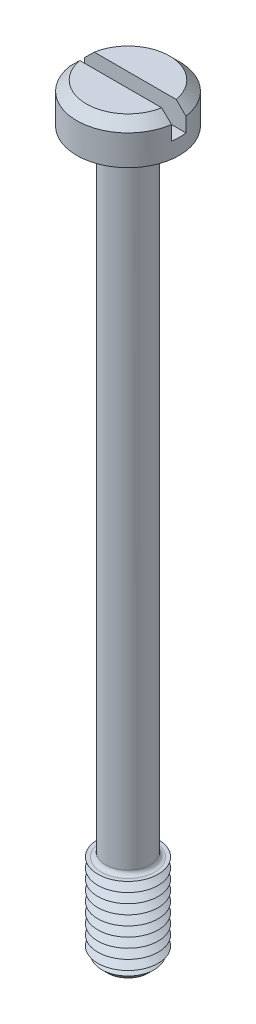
ISO-10303-21;
HEADER;
FILE_DESCRIPTION(('STEP AP214'),'2;1');
FILE_NAME('part.step','',(''),(''),'','','');
FILE_SCHEMA(('AUTOMOTIVE_DESIGN { 1 0 10303 214 1 1 1 1 }'));
ENDSEC;
DATA;
#1=APPLICATION_CONTEXT('core data for automotive mechanical design processes');
#2=APPLICATION_PROTOCOL_DEFINITION('international standard','automotive_design',2000,#1);
#3=PRODUCT_CONTEXT('',#1,'mechanical');
#4=PRODUCT('Part','Part','',(#3));
#5=PRODUCT_RELATED_PRODUCT_CATEGORY('part','',(#4));
#6=PRODUCT_DEFINITION_FORMATION('','',#4);
#7=PRODUCT_DEFINITION_CONTEXT('part definition',#1,'design');
#8=PRODUCT_DEFINITION('design','',#6,#7);
#9=PRODUCT_DEFINITION_SHAPE('','',#8);
#10=(LENGTH_UNIT() NAMED_UNIT(*) SI_UNIT(.MILLI.,.METRE.));
#11=(NAMED_UNIT(*) PLANE_ANGLE_UNIT() SI_UNIT($,.RADIAN.));
#12=(NAMED_UNIT(*) SI_UNIT($,.STERADIAN.) SOLID_ANGLE_UNIT());
#13=UNCERTAINTY_MEASURE_WITH_UNIT(LENGTH_MEASURE(1.E-05),#10,'distance_accuracy_value','');
#14=(GEOMETRIC_REPRESENTATION_CONTEXT(3) GLOBAL_UNCERTAINTY_ASSIGNED_CONTEXT((#13)) GLOBAL_UNIT_ASSIGNED_CONTEXT((#10,
#11,#12)) REPRESENTATION_CONTEXT('',''));
#15=CARTESIAN_POINT('',(0.,0.,0.));
#16=DIRECTION('',(0.,0.,1.));
#17=DIRECTION('',(1.,0.,0.));
#18=AXIS2_PLACEMENT_3D('',#15,#16,#17);
#19=CARTESIAN_POINT('',(0.,3.3,0.));
#20=DIRECTION('',(0.,1.,0.));
#21=DIRECTION('',(0.,0.,1.));
#22=AXIS2_PLACEMENT_3D('',#19,#20,#21);
#23=PLANE('',#22);
#24=DIRECTION('',(-1.,0.,0.));
#25=VECTOR('',#24,1.);
#26=CARTESIAN_POINT('',(4.25,3.3,-0.6));
#27=LINE('',#26,#25);
#28=CARTESIAN_POINT('',(3.39742549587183,3.3,-0.6));
#29=VERTEX_POINT('',#28);
#30=CARTESIAN_POINT('',(-3.39742549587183,3.3,-0.6));
#31=VERTEX_POINT('',#30);
#32=EDGE_CURVE('E110',#29,#31,#27,.T.);
#33=ORIENTED_EDGE('',*,*,#32,.F.);
#34=CARTESIAN_POINT('',(0.,3.3,0.));
#35=DIRECTION('',(0.,1.,0.));
#36=DIRECTION('',(0.,0.,1.));
#37=AXIS2_PLACEMENT_3D('',#34,#35,#36);
#38=CIRCLE('',#37,3.44999999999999);
#39=EDGE_CURVE('E113',#29,#31,#38,.T.);
#40=ORIENTED_EDGE('',*,*,#39,.T.);
#41=EDGE_LOOP('',(#33,#40));
#42=FACE_BOUND('',#41,.T.);
#43=ADVANCED_FACE('F39',(#42),#23,.T.);
#44=CARTESIAN_POINT('',(0.,3.3,0.));
#45=DIRECTION('',(0.,-1.,0.));
#46=DIRECTION('',(0.,0.,-1.));
#47=AXIS2_PLACEMENT_3D('',#44,#45,#46);
#48=CONICAL_SURFACE('',#47,3.44999999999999,0.785398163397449);
#49=CARTESIAN_POINT('',(9.35351408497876,-2.62273843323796,-0.6));
#50=CARTESIAN_POINT('',(9.03263557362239,-2.30252317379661,-0.6));
#51=CARTESIAN_POINT('',(8.7117281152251,-1.98233690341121,-0.6));
#52=CARTESIAN_POINT('',(8.069812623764,-1.34205341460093,-0.6));
#53=CARTESIAN_POINT('',(7.7488045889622,-1.02195619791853,-0.6));
#54=CARTESIAN_POINT('',(7.10652460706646,-0.381761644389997,-0.6));
#55=CARTESIAN_POINT('',(6.78525260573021,-0.0616643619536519,-0.6));
#56=CARTESIAN_POINT('',(6.14251393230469,0.578323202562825,-0.6));
#57=CARTESIAN_POINT('',(5.82104726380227,0.898213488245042,-0.6));
#58=CARTESIAN_POINT('',(5.1719620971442,1.54347500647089,-0.6));
#59=CARTESIAN_POINT('',(4.84433778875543,1.86884039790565,-0.6));
#60=CARTESIAN_POINT('',(4.35244442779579,2.35644593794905,-0.6));
#61=CARTESIAN_POINT('',(4.18839924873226,2.51891187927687,-0.6));
#62=CARTESIAN_POINT('',(3.86009606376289,2.84362679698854,-0.6));
#63=CARTESIAN_POINT('',(3.69583805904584,3.00587577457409,-0.6));
#64=CARTESIAN_POINT('',(3.36705354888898,3.33001661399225,-0.6));
#65=CARTESIAN_POINT('',(3.20252712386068,3.49190855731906,-0.6));
#66=CARTESIAN_POINT('',(2.87298689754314,3.81520272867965,-0.6));
#67=CARTESIAN_POINT('',(2.70797308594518,3.97660494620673,-0.6));
#68=CARTESIAN_POINT('',(2.37716903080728,4.29858210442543,-0.6));
#69=CARTESIAN_POINT('',(2.2113788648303,4.45915712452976,-0.6));
#70=CARTESIAN_POINT('',(1.96157219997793,4.6988460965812,-0.6));
#71=CARTESIAN_POINT('',(1.87811785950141,4.77854546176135,-0.6));
#72=CARTESIAN_POINT('',(1.71066064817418,4.93736532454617,-0.6));
#73=CARTESIAN_POINT('',(1.62665778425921,5.01648582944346,-0.6));
#74=CARTESIAN_POINT('',(1.49655488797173,5.13773269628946,-0.6));
#75=CARTESIAN_POINT('',(1.45074972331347,5.1801752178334,-0.6));
#76=CARTESIAN_POINT('',(1.35882119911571,5.26471614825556,-0.6));
#77=CARTESIAN_POINT('',(1.31269783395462,5.30681455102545,-0.6));
#78=CARTESIAN_POINT('',(1.22008852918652,5.39050695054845,-0.6));
#79=CARTESIAN_POINT('',(1.17360305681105,5.4321014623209,-0.6));
#80=CARTESIAN_POINT('',(1.08007401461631,5.51465347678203,-0.6));
#81=CARTESIAN_POINT('',(1.03303046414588,5.55561100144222,-0.6));
#82=CARTESIAN_POINT('',(0.919047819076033,5.65299331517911,-0.6));
#83=CARTESIAN_POINT('',(0.851738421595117,5.70899242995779,-0.6));
#84=CARTESIAN_POINT('',(0.748806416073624,5.79068526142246,-0.6));
#85=CARTESIAN_POINT('',(0.714125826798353,5.81756213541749,-0.6));
#86=CARTESIAN_POINT('',(0.643915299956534,5.87018079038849,-0.6));
#87=CARTESIAN_POINT('',(0.608385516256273,5.89592277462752,-0.6));
#88=CARTESIAN_POINT('',(0.545162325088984,5.93955652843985,-0.6));
#89=CARTESIAN_POINT('',(0.517718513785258,5.95780799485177,-0.6));
#90=CARTESIAN_POINT('',(0.462025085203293,5.99303174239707,-0.6));
#91=CARTESIAN_POINT('',(0.433775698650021,6.01000438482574,-0.6));
#92=CARTESIAN_POINT('',(0.376341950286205,6.04213837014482,-0.6));
#93=CARTESIAN_POINT('',(0.347160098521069,6.05730412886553,-0.6));
#94=CARTESIAN_POINT('',(0.287642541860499,6.0851339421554,-0.6));
#95=CARTESIAN_POINT('',(0.257308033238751,6.09780051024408,-0.6));
#96=CARTESIAN_POINT('',(0.190863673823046,6.12124627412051,-0.6));
#97=CARTESIAN_POINT('',(0.154554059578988,6.1314857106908,-0.6));
#98=CARTESIAN_POINT('',(0.0807909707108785,6.1456540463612,-0.6));
#99=CARTESIAN_POINT('',(0.0433423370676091,6.14960664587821,-0.6));
#100=CARTESIAN_POINT('',(-0.03179874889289,6.15033783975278,-0.6));
#101=CARTESIAN_POINT('',(-0.0694915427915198,6.14708428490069,-0.6));
#102=CARTESIAN_POINT('',(-0.143790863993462,6.13410921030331,-0.6));
#103=CARTESIAN_POINT('',(-0.180393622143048,6.1243674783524,-0.6));
#104=CARTESIAN_POINT('',(-0.254098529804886,6.09939647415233,-0.6));
#105=CARTESIAN_POINT('',(-0.291094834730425,6.0838685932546,-0.6));
#106=CARTESIAN_POINT('',(-0.363408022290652,6.0492466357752,-0.6));
#107=CARTESIAN_POINT('',(-0.398721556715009,6.03014579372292,-0.6));
#108=CARTESIAN_POINT('',(-0.468234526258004,5.98944452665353,-0.6));
#109=CARTESIAN_POINT('',(-0.502422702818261,5.96782521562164,-0.6));
#110=CARTESIAN_POINT('',(-0.569689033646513,5.92300618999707,-0.6));
#111=CARTESIAN_POINT('',(-0.602768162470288,5.89980792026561,-0.6));
#112=CARTESIAN_POINT('',(-0.671148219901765,5.85008963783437,-0.6));
#113=CARTESIAN_POINT('',(-0.706369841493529,5.82346130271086,-0.6));
#114=CARTESIAN_POINT('',(-0.776087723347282,5.76926828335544,-0.6));
#115=CARTESIAN_POINT('',(-0.810583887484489,5.74170347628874,-0.6));
#116=CARTESIAN_POINT('',(-0.913286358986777,5.6579827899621,-0.6));
#117=CARTESIAN_POINT('',(-0.98067372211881,5.60082541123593,-0.6));
#118=CARTESIAN_POINT('',(-1.11424616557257,5.48490670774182,-0.6));
#119=CARTESIAN_POINT('',(-1.18042891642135,5.42614273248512,-0.6));
#120=CARTESIAN_POINT('',(-1.31191262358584,5.30767463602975,-0.6));
#121=CARTESIAN_POINT('',(-1.37721382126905,5.24797078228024,-0.6));
#122=CARTESIAN_POINT('',(-1.50701089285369,5.12812906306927,-0.6));
#123=CARTESIAN_POINT('',(-1.57150872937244,5.06799331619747,-0.6));
#124=CARTESIAN_POINT('',(-1.70009132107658,4.94727328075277,-0.6));
#125=CARTESIAN_POINT('',(-1.76417604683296,4.88668896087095,-0.6));
#126=CARTESIAN_POINT('',(-1.95584105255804,4.70458824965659,-0.6));
#127=CARTESIAN_POINT('',(-2.08296922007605,4.58259645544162,-0.6));
#128=CARTESIAN_POINT('',(-2.33599178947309,4.33840625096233,-0.6));
#129=CARTESIAN_POINT('',(-2.46188913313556,4.21621087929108,-0.6));
#130=CARTESIAN_POINT('',(-2.71323511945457,3.97135925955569,-0.6));
#131=CARTESIAN_POINT('',(-2.83868376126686,3.84870301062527,-0.6));
#132=CARTESIAN_POINT('',(-3.21459106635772,3.48027743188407,-0.6));
#133=CARTESIAN_POINT('',(-3.46460626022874,3.23405597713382,-0.6));
#134=CARTESIAN_POINT('',(-3.96413793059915,2.74090313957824,-0.6));
#135=CARTESIAN_POINT('',(-4.21365415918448,2.49397150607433,-0.6));
#136=CARTESIAN_POINT('',(-4.71232475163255,1.9997473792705,-0.6));
#137=CARTESIAN_POINT('',(-4.96147911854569,1.75245488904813,-0.6));
#138=CARTESIAN_POINT('',(-5.45958725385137,1.25761544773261,-0.6));
#139=CARTESIAN_POINT('',(-5.70854099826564,1.01006847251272,-0.6));
#140=CARTESIAN_POINT('',(-6.20629498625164,0.514819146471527,-0.6));
#141=CARTESIAN_POINT('',(-6.45509522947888,0.267116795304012,-0.6));
#142=CARTESIAN_POINT('',(-7.20128563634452,-0.476100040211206,-0.6));
#143=CARTESIAN_POINT('',(-7.69851620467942,-0.971774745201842,-0.6));
#144=CARTESIAN_POINT('',(-8.38865115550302,-1.66007026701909,-0.6));
#145=CARTESIAN_POINT('',(-8.58165346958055,-1.85259293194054,-0.6));
#146=CARTESIAN_POINT('',(-8.87112736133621,-2.1413922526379,-0.6));
#147=CARTESIAN_POINT('',(-8.96761014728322,-2.23765767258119,-0.6));
#148=CARTESIAN_POINT('',(-9.16056764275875,-2.43019387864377,-0.6));
#149=CARTESIAN_POINT('',(-9.25704235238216,-2.52646466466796,-0.6));
#150=CARTESIAN_POINT('',(-9.35351408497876,-2.62273843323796,-0.6));
#151=B_SPLINE_CURVE_WITH_KNOTS('',3,(#49,#50,#51,#52,#53,#54,#55,#56,#57,#58,#59,#60,#61,#62,
#63,#64,#65,#66,#67,#68,#69,#70,#71,#72,#73,#74,#75,#76,#77,#78,#79,#80,#81,#82,#83,#84,#85,#86,
#87,#88,#89,#90,#91,#92,#93,#94,#95,#96,#97,#98,#99,#100,#101,#102,#103,#104,#105,#106,#107,
#108,#109,#110,#111,#112,#113,#114,#115,#116,#117,#118,#119,#120,#121,#122,#123,#124,#125,#126,
#127,#128,#129,#130,#131,#132,#133,#134,#135,#136,#137,#138,#139,#140,#141,#142,#143,#144,#145,
#146,#147,#148,#149,#150),.UNSPECIFIED.,.F.,.F.,(4,2,2,2,2,2,2,2,2,2,2,2,2,2,2,2,2,2,2,2,2,2,2,
2,2,2,2,2,2,2,2,2,2,2,2,2,2,2,2,2,2,2,2,2,2,2,2,2,2,2,4),(0.,1.35996600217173,2.71995696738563,
4.08050889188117,5.44103646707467,6.82624457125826,7.5188872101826,8.21152599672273,
8.90398568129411,9.59646011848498,10.288866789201,10.6350581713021,10.9812451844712,
11.1685812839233,11.3559207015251,11.5430489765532,11.7301707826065,11.9927784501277,
12.1243921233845,12.2559821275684,12.3548333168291,12.4536564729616,12.5522329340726,
12.6507097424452,12.763461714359,12.8757876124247,12.9886156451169,13.101796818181,
13.2218851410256,13.3422031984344,13.4634899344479,13.584667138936,13.7171086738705,
13.8495676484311,14.1146090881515,14.3801178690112,14.6455524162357,14.910099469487,
15.17466516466,15.7032346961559,16.2295761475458,16.755918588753,17.808623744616,
18.8617626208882,19.9148925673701,20.9681337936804,22.0213773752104,24.1276499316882,
24.9454725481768,25.3543534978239,25.7632286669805),.UNSPECIFIED.);
#152=CARTESIAN_POINT('',(4.20743389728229,2.5,-0.6));
#153=VERTEX_POINT('',#152);
#154=EDGE_CURVE('E268',#153,#29,#151,.T.);
#155=ORIENTED_EDGE('',*,*,#154,.F.);
#156=CARTESIAN_POINT('',(0.,2.5,0.));
#157=DIRECTION('',(0.,1.,0.));
#158=DIRECTION('',(0.,0.,1.));
#159=AXIS2_PLACEMENT_3D('',#156,#157,#158);
#160=CIRCLE('',#159,4.25);
#161=CARTESIAN_POINT('',(-4.20743389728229,2.49999999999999,-0.6));
#162=VERTEX_POINT('',#161);
#163=EDGE_CURVE('E128',#162,#153,#160,.F.);
#164=ORIENTED_EDGE('',*,*,#163,.F.);
#165=EDGE_CURVE('E102',#31,#162,#151,.T.);
#166=ORIENTED_EDGE('',*,*,#165,.F.);
#167=ORIENTED_EDGE('',*,*,#39,.F.);
#168=EDGE_LOOP('',(#155,#164,#166,#167));
#169=FACE_BOUND('',#168,.T.);
#170=ADVANCED_FACE('F230',(#169),#48,.T.);
#171=CARTESIAN_POINT('',(0.,-60.,0.));
#172=DIRECTION('',(0.,1.,0.));
#173=DIRECTION('',(0.,0.,1.));
#174=AXIS2_PLACEMENT_3D('',#171,#172,#173);
#175=CYLINDRICAL_SURFACE('',#174,1.85);
#176=CARTESIAN_POINT('',(0.,-52.15,0.));
#177=DIRECTION('',(0.,-1.,0.));
#178=DIRECTION('',(0.,0.,-1.));
#179=AXIS2_PLACEMENT_3D('',#176,#177,#178);
#180=CIRCLE('',#179,1.85);
#181=CARTESIAN_POINT('',(0.,-52.15,-1.85));
#182=VERTEX_POINT('',#181);
#183=EDGE_CURVE('E123',#182,#182,#180,.F.);
#184=ORIENTED_EDGE('',*,*,#183,.T.);
#185=EDGE_LOOP('',(#184));
#186=FACE_BOUND('',#185,.T.);
#187=CARTESIAN_POINT('',(0.,-0.350000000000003,0.));
#188=DIRECTION('',(0.,1.,0.));
#189=DIRECTION('',(0.,0.,1.));
#190=AXIS2_PLACEMENT_3D('',#187,#188,#189);
#191=CIRCLE('',#190,1.85);
#192=CARTESIAN_POINT('',(0.,-0.350000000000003,1.85));
#193=VERTEX_POINT('',#192);
#194=EDGE_CURVE('E381',#193,#193,#191,.F.);
#195=ORIENTED_EDGE('',*,*,#194,.T.);
#196=EDGE_LOOP('',(#195));
#197=FACE_BOUND('',#196,.T.);
#198=ADVANCED_FACE('F226',(#186,#197),#175,.T.);
#199=CARTESIAN_POINT('',(0.,3.3,0.));
#200=DIRECTION('',(0.,-1.,0.));
#201=DIRECTION('',(0.,0.,-1.));
#202=AXIS2_PLACEMENT_3D('',#199,#200,#201);
#203=CYLINDRICAL_SURFACE('',#202,4.25);
#204=ORIENTED_EDGE('',*,*,#163,.T.);
#205=DIRECTION('',(0.,-1.,0.));
#206=VECTOR('',#205,1.);
#207=CARTESIAN_POINT('',(4.20743389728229,3.3,-0.6));
#208=LINE('',#207,#206);
#209=CARTESIAN_POINT('',(4.20743389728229,1.3,-0.6));
#210=VERTEX_POINT('',#209);
#211=EDGE_CURVE('E64',#153,#210,#208,.T.);
#212=ORIENTED_EDGE('',*,*,#211,.T.);
#213=CARTESIAN_POINT('',(0.,1.3,0.));
#214=DIRECTION('',(0.,1.,0.));
#215=DIRECTION('',(0.,0.,1.));
#216=AXIS2_PLACEMENT_3D('',#213,#214,#215);
#217=CIRCLE('',#216,4.25);
#218=CARTESIAN_POINT('',(4.20743389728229,1.3,0.6));
#219=VERTEX_POINT('',#218);
#220=EDGE_CURVE('E11',#219,#210,#217,.T.);
#221=ORIENTED_EDGE('',*,*,#220,.F.);
#222=DIRECTION('',(0.,-1.,0.));
#223=VECTOR('',#222,1.);
#224=CARTESIAN_POINT('',(4.20743389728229,3.3,0.6));
#225=LINE('',#224,#223);
#226=CARTESIAN_POINT('',(4.20743389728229,2.49999999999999,0.6));
#227=VERTEX_POINT('',#226);
#228=EDGE_CURVE('E284',#219,#227,#225,.F.);
#229=ORIENTED_EDGE('',*,*,#228,.T.);
#230=CARTESIAN_POINT('',(-4.20743389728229,2.5,0.6));
#231=VERTEX_POINT('',#230);
#232=EDGE_CURVE('E120',#227,#231,#160,.F.);
#233=ORIENTED_EDGE('',*,*,#232,.T.);
#234=DIRECTION('',(0.,-1.,0.));
#235=VECTOR('',#234,1.);
#236=CARTESIAN_POINT('',(-4.20743389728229,3.3,0.6));
#237=LINE('',#236,#235);
#238=CARTESIAN_POINT('',(-4.20743389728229,1.3,0.6));
#239=VERTEX_POINT('',#238);
#240=EDGE_CURVE('E96',#231,#239,#237,.T.);
#241=ORIENTED_EDGE('',*,*,#240,.T.);
#242=CARTESIAN_POINT('',(-4.20743389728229,1.3,-0.6));
#243=VERTEX_POINT('',#242);
#244=EDGE_CURVE('E44',#243,#239,#217,.T.);
#245=ORIENTED_EDGE('',*,*,#244,.F.);
#246=DIRECTION('',(0.,-1.,0.));
#247=VECTOR('',#246,1.);
#248=CARTESIAN_POINT('',(-4.20743389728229,3.3,-0.6));
#249=LINE('',#248,#247);
#250=EDGE_CURVE('E289',#243,#162,#249,.F.);
#251=ORIENTED_EDGE('',*,*,#250,.T.);
#252=EDGE_LOOP('',(#204,#212,#221,#229,#233,#241,#245,#251));
#253=FACE_BOUND('',#252,.T.);
#254=CARTESIAN_POINT('',(0.,0.,0.));
#255=DIRECTION('',(0.,1.,0.));
#256=DIRECTION('',(0.,0.,1.));
#257=AXIS2_PLACEMENT_3D('',#254,#255,#256);
#258=CIRCLE('',#257,4.25);
#259=CARTESIAN_POINT('',(0.,0.,4.25));
#260=VERTEX_POINT('',#259);
#261=EDGE_CURVE('E367',#260,#260,#258,.T.);
#262=ORIENTED_EDGE('',*,*,#261,.T.);
#263=EDGE_LOOP('',(#262));
#264=FACE_BOUND('',#263,.T.);
#265=ADVANCED_FACE('F229',(#253,#264),#203,.T.);
#266=DIRECTION('',(1.,0.,0.));
#267=VECTOR('',#266,1.);
#268=CARTESIAN_POINT('',(4.25,3.3,0.6));
#269=LINE('',#268,#267);
#270=CARTESIAN_POINT('',(-3.39742549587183,3.3,0.6));
#271=VERTEX_POINT('',#270);
#272=CARTESIAN_POINT('',(3.39742549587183,3.3,0.6));
#273=VERTEX_POINT('',#272);
#274=EDGE_CURVE('E56',#271,#273,#269,.T.);
#275=ORIENTED_EDGE('',*,*,#274,.F.);
#276=EDGE_CURVE('E108',#271,#273,#38,.T.);
#277=ORIENTED_EDGE('',*,*,#276,.T.);
#278=EDGE_LOOP('',(#275,#277));
#279=FACE_BOUND('',#278,.T.);
#280=ADVANCED_FACE('F107',(#279),#23,.T.);
#281=CARTESIAN_POINT('',(0.,0.,0.));
#282=DIRECTION('',(0.,1.,0.));
#283=DIRECTION('',(0.,0.,1.));
#284=AXIS2_PLACEMENT_3D('',#281,#282,#283);
#285=PLANE('',#284);
#286=CARTESIAN_POINT('',(0.,0.,0.));
#287=DIRECTION('',(0.,1.,0.));
#288=DIRECTION('',(0.,0.,1.));
#289=AXIS2_PLACEMENT_3D('',#286,#287,#288);
#290=CIRCLE('',#289,2.2);
#291=CARTESIAN_POINT('',(0.,0.,2.2));
#292=VERTEX_POINT('',#291);
#293=EDGE_CURVE('E114',#292,#292,#290,.T.);
#294=ORIENTED_EDGE('',*,*,#293,.T.);
#295=EDGE_LOOP('',(#294));
#296=FACE_BOUND('',#295,.T.);
#297=ORIENTED_EDGE('',*,*,#261,.F.);
#298=EDGE_LOOP('',(#297));
#299=FACE_BOUND('',#298,.T.);
#300=ADVANCED_FACE('F220',(#296,#299),#285,.F.);
#301=CARTESIAN_POINT('',(0.,-52.5,0.));
#302=DIRECTION('',(0.,-1.,0.));
#303=DIRECTION('',(0.,0.,-1.));
#304=AXIS2_PLACEMENT_3D('',#301,#302,#303);
#305=PLANE('',#304);
#306=CARTESIAN_POINT('',(0.,-52.5,0.));
#307=DIRECTION('',(0.,-1.,0.));
#308=DIRECTION('',(0.,0.,-1.));
#309=AXIS2_PLACEMENT_3D('',#306,#307,#308);
#310=CIRCLE('',#309,2.2);
#311=CARTESIAN_POINT('',(0.,-52.5,-2.2));
#312=VERTEX_POINT('',#311);
#313=EDGE_CURVE('E375',#312,#312,#310,.T.);
#314=ORIENTED_EDGE('',*,*,#313,.T.);
#315=EDGE_LOOP('',(#314));
#316=FACE_BOUND('',#315,.T.);
#317=CARTESIAN_POINT('',(0.,-52.5,0.));
#318=DIRECTION('',(0.,1.,0.));
#319=DIRECTION('',(0.,0.,1.));
#320=AXIS2_PLACEMENT_3D('',#317,#318,#319);
#321=CIRCLE('',#320,2.5);
#322=CARTESIAN_POINT('',(0.,-52.5,2.5));
#323=VERTEX_POINT('',#322);
#324=EDGE_CURVE('E363',#323,#323,#321,.T.);
#325=ORIENTED_EDGE('',*,*,#324,.T.);
#326=EDGE_LOOP('',(#325));
#327=FACE_BOUND('',#326,.T.);
#328=ADVANCED_FACE('F216',(#316,#327),#305,.F.);
#329=CARTESIAN_POINT('',(0.,-52.9,0.));
#330=DIRECTION('',(0.,1.,0.));
#331=DIRECTION('',(0.,0.,1.));
#332=AXIS2_PLACEMENT_3D('',#329,#330,#331);
#333=CONICAL_SURFACE('',#332,1.80717967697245,1.04719755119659);
#334=ORIENTED_EDGE('',*,*,#324,.F.);
#335=EDGE_LOOP('',(#334));
#336=FACE_BOUND('',#335,.T.);
#337=CARTESIAN_POINT('',(0.,-52.9,0.));
#338=DIRECTION('',(0.,1.,0.));
#339=DIRECTION('',(0.,0.,1.));
#340=AXIS2_PLACEMENT_3D('',#337,#338,#339);
#341=CIRCLE('',#340,1.80717967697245);
#342=CARTESIAN_POINT('',(0.,-52.9,1.80717967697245));
#343=VERTEX_POINT('',#342);
#344=EDGE_CURVE('E360',#343,#343,#341,.T.);
#345=ORIENTED_EDGE('',*,*,#344,.T.);
#346=EDGE_LOOP('',(#345));
#347=FACE_BOUND('',#346,.T.);
#348=ADVANCED_FACE('F212',(#336,#347),#333,.T.);
#349=CARTESIAN_POINT('',(0.,-53.3,0.));
#350=DIRECTION('',(0.,-1.,0.));
#351=DIRECTION('',(0.,0.,-1.));
#352=AXIS2_PLACEMENT_3D('',#349,#350,#351);
#353=CONICAL_SURFACE('',#352,2.5,1.0471975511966);
#354=ORIENTED_EDGE('',*,*,#344,.F.);
#355=EDGE_LOOP('',(#354));
#356=FACE_BOUND('',#355,.T.);
#357=CARTESIAN_POINT('',(0.,-53.3,0.));
#358=DIRECTION('',(0.,1.,0.));
#359=DIRECTION('',(0.,0.,1.));
#360=AXIS2_PLACEMENT_3D('',#357,#358,#359);
#361=CIRCLE('',#360,2.5);
#362=CARTESIAN_POINT('',(0.,-53.3,2.5));
#363=VERTEX_POINT('',#362);
#364=EDGE_CURVE('E356',#363,#363,#361,.T.);
#365=ORIENTED_EDGE('',*,*,#364,.T.);
#366=EDGE_LOOP('',(#365));
#367=FACE_BOUND('',#366,.T.);
#368=ADVANCED_FACE('F208',(#356,#367),#353,.T.);
#369=CARTESIAN_POINT('',(0.,-53.7,0.));
#370=DIRECTION('',(0.,1.,0.));
#371=DIRECTION('',(0.,0.,1.));
#372=AXIS2_PLACEMENT_3D('',#369,#370,#371);
#373=CONICAL_SURFACE('',#372,1.80717967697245,1.04719755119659);
#374=ORIENTED_EDGE('',*,*,#364,.F.);
#375=EDGE_LOOP('',(#374));
#376=FACE_BOUND('',#375,.T.);
#377=CARTESIAN_POINT('',(0.,-53.7,0.));
#378=DIRECTION('',(0.,1.,0.));
#379=DIRECTION('',(0.,0.,1.));
#380=AXIS2_PLACEMENT_3D('',#377,#378,#379);
#381=CIRCLE('',#380,1.80717967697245);
#382=CARTESIAN_POINT('',(0.,-53.7,1.80717967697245));
#383=VERTEX_POINT('',#382);
#384=EDGE_CURVE('E352',#383,#383,#381,.T.);
#385=ORIENTED_EDGE('',*,*,#384,.T.);
#386=EDGE_LOOP('',(#385));
#387=FACE_BOUND('',#386,.T.);
#388=ADVANCED_FACE('F204',(#376,#387),#373,.T.);
#389=CARTESIAN_POINT('',(0.,-54.1,0.));
#390=DIRECTION('',(0.,-1.,0.));
#391=DIRECTION('',(0.,0.,-1.));
#392=AXIS2_PLACEMENT_3D('',#389,#390,#391);
#393=CONICAL_SURFACE('',#392,2.5,1.0471975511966);
#394=ORIENTED_EDGE('',*,*,#384,.F.);
#395=EDGE_LOOP('',(#394));
#396=FACE_BOUND('',#395,.T.);
#397=CARTESIAN_POINT('',(0.,-54.1,0.));
#398=DIRECTION('',(0.,1.,0.));
#399=DIRECTION('',(0.,0.,1.));
#400=AXIS2_PLACEMENT_3D('',#397,#398,#399);
#401=CIRCLE('',#400,2.5);
#402=CARTESIAN_POINT('',(0.,-54.1,2.5));
#403=VERTEX_POINT('',#402);
#404=EDGE_CURVE('E348',#403,#403,#401,.T.);
#405=ORIENTED_EDGE('',*,*,#404,.T.);
#406=EDGE_LOOP('',(#405));
#407=FACE_BOUND('',#406,.T.);
#408=ADVANCED_FACE('F200',(#396,#407),#393,.T.);
#409=CARTESIAN_POINT('',(0.,-54.5,0.));
#410=DIRECTION('',(0.,1.,0.));
#411=DIRECTION('',(0.,0.,1.));
#412=AXIS2_PLACEMENT_3D('',#409,#410,#411);
#413=CONICAL_SURFACE('',#412,1.80717967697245,1.04719755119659);
#414=ORIENTED_EDGE('',*,*,#404,.F.);
#415=EDGE_LOOP('',(#414));
#416=FACE_BOUND('',#415,.T.);
#417=CARTESIAN_POINT('',(0.,-54.5,0.));
#418=DIRECTION('',(0.,1.,0.));
#419=DIRECTION('',(0.,0.,1.));
#420=AXIS2_PLACEMENT_3D('',#417,#418,#419);
#421=CIRCLE('',#420,1.80717967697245);
#422=CARTESIAN_POINT('',(0.,-54.5,1.80717967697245));
#423=VERTEX_POINT('',#422);
#424=EDGE_CURVE('E344',#423,#423,#421,.T.);
#425=ORIENTED_EDGE('',*,*,#424,.T.);
#426=EDGE_LOOP('',(#425));
#427=FACE_BOUND('',#426,.T.);
#428=ADVANCED_FACE('F196',(#416,#427),#413,.T.);
#429=CARTESIAN_POINT('',(0.,-54.9,0.));
#430=DIRECTION('',(0.,-1.,0.));
#431=DIRECTION('',(0.,0.,-1.));
#432=AXIS2_PLACEMENT_3D('',#429,#430,#431);
#433=CONICAL_SURFACE('',#432,2.5,1.0471975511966);
#434=ORIENTED_EDGE('',*,*,#424,.F.);
#435=EDGE_LOOP('',(#434));
#436=FACE_BOUND('',#435,.T.);
#437=CARTESIAN_POINT('',(0.,-54.9,0.));
#438=DIRECTION('',(0.,1.,0.));
#439=DIRECTION('',(0.,0.,1.));
#440=AXIS2_PLACEMENT_3D('',#437,#438,#439);
#441=CIRCLE('',#440,2.5);
#442=CARTESIAN_POINT('',(0.,-54.9,2.5));
#443=VERTEX_POINT('',#442);
#444=EDGE_CURVE('E340',#443,#443,#441,.T.);
#445=ORIENTED_EDGE('',*,*,#444,.T.);
#446=EDGE_LOOP('',(#445));
#447=FACE_BOUND('',#446,.T.);
#448=ADVANCED_FACE('F192',(#436,#447),#433,.T.);
#449=CARTESIAN_POINT('',(0.,-55.3,0.));
#450=DIRECTION('',(0.,1.,0.));
#451=DIRECTION('',(0.,0.,1.));
#452=AXIS2_PLACEMENT_3D('',#449,#450,#451);
#453=CONICAL_SURFACE('',#452,1.80717967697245,1.04719755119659);
#454=ORIENTED_EDGE('',*,*,#444,.F.);
#455=EDGE_LOOP('',(#454));
#456=FACE_BOUND('',#455,.T.);
#457=CARTESIAN_POINT('',(0.,-55.3,0.));
#458=DIRECTION('',(0.,1.,0.));
#459=DIRECTION('',(0.,0.,1.));
#460=AXIS2_PLACEMENT_3D('',#457,#458,#459);
#461=CIRCLE('',#460,1.80717967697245);
#462=CARTESIAN_POINT('',(0.,-55.3,1.80717967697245));
#463=VERTEX_POINT('',#462);
#464=EDGE_CURVE('E336',#463,#463,#461,.T.);
#465=ORIENTED_EDGE('',*,*,#464,.T.);
#466=EDGE_LOOP('',(#465));
#467=FACE_BOUND('',#466,.T.);
#468=ADVANCED_FACE('F188',(#456,#467),#453,.T.);
#469=CARTESIAN_POINT('',(0.,-55.7,0.));
#470=DIRECTION('',(0.,-1.,0.));
#471=DIRECTION('',(0.,0.,-1.));
#472=AXIS2_PLACEMENT_3D('',#469,#470,#471);
#473=CONICAL_SURFACE('',#472,2.5,1.0471975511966);
#474=ORIENTED_EDGE('',*,*,#464,.F.);
#475=EDGE_LOOP('',(#474));
#476=FACE_BOUND('',#475,.T.);
#477=CARTESIAN_POINT('',(0.,-55.7,0.));
#478=DIRECTION('',(0.,1.,0.));
#479=DIRECTION('',(0.,0.,1.));
#480=AXIS2_PLACEMENT_3D('',#477,#478,#479);
#481=CIRCLE('',#480,2.5);
#482=CARTESIAN_POINT('',(0.,-55.7,2.5));
#483=VERTEX_POINT('',#482);
#484=EDGE_CURVE('E333',#483,#483,#481,.T.);
#485=ORIENTED_EDGE('',*,*,#484,.T.);
#486=EDGE_LOOP('',(#485));
#487=FACE_BOUND('',#486,.T.);
#488=ADVANCED_FACE('F184',(#476,#487),#473,.T.);
#489=CARTESIAN_POINT('',(0.,-56.1,0.));
#490=DIRECTION('',(0.,1.,0.));
#491=DIRECTION('',(0.,0.,1.));
#492=AXIS2_PLACEMENT_3D('',#489,#490,#491);
#493=CONICAL_SURFACE('',#492,1.80717967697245,1.04719755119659);
#494=ORIENTED_EDGE('',*,*,#484,.F.);
#495=EDGE_LOOP('',(#494));
#496=FACE_BOUND('',#495,.T.);
#497=CARTESIAN_POINT('',(0.,-56.1,0.));
#498=DIRECTION('',(0.,1.,0.));
#499=DIRECTION('',(0.,0.,1.));
#500=AXIS2_PLACEMENT_3D('',#497,#498,#499);
#501=CIRCLE('',#500,1.80717967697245);
#502=CARTESIAN_POINT('',(0.,-56.1,1.80717967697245));
#503=VERTEX_POINT('',#502);
#504=EDGE_CURVE('E329',#503,#503,#501,.T.);
#505=ORIENTED_EDGE('',*,*,#504,.T.);
#506=EDGE_LOOP('',(#505));
#507=FACE_BOUND('',#506,.T.);
#508=ADVANCED_FACE('F180',(#496,#507),#493,.T.);
#509=CARTESIAN_POINT('',(0.,-56.5,0.));
#510=DIRECTION('',(0.,-1.,0.));
#511=DIRECTION('',(0.,0.,-1.));
#512=AXIS2_PLACEMENT_3D('',#509,#510,#511);
#513=CONICAL_SURFACE('',#512,2.5,1.0471975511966);
#514=ORIENTED_EDGE('',*,*,#504,.F.);
#515=EDGE_LOOP('',(#514));
#516=FACE_BOUND('',#515,.T.);
#517=CARTESIAN_POINT('',(0.,-56.5,0.));
#518=DIRECTION('',(0.,1.,0.));
#519=DIRECTION('',(0.,0.,1.));
#520=AXIS2_PLACEMENT_3D('',#517,#518,#519);
#521=CIRCLE('',#520,2.5);
#522=CARTESIAN_POINT('',(0.,-56.5,2.5));
#523=VERTEX_POINT('',#522);
#524=EDGE_CURVE('E325',#523,#523,#521,.T.);
#525=ORIENTED_EDGE('',*,*,#524,.T.);
#526=EDGE_LOOP('',(#525));
#527=FACE_BOUND('',#526,.T.);
#528=ADVANCED_FACE('F176',(#516,#527),#513,.T.);
#529=CARTESIAN_POINT('',(0.,-56.9,0.));
#530=DIRECTION('',(0.,1.,0.));
#531=DIRECTION('',(0.,0.,1.));
#532=AXIS2_PLACEMENT_3D('',#529,#530,#531);
#533=CONICAL_SURFACE('',#532,1.80717967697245,1.04719755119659);
#534=ORIENTED_EDGE('',*,*,#524,.F.);
#535=EDGE_LOOP('',(#534));
#536=FACE_BOUND('',#535,.T.);
#537=CARTESIAN_POINT('',(0.,-56.9,0.));
#538=DIRECTION('',(0.,1.,0.));
#539=DIRECTION('',(0.,0.,1.));
#540=AXIS2_PLACEMENT_3D('',#537,#538,#539);
#541=CIRCLE('',#540,1.80717967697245);
#542=CARTESIAN_POINT('',(0.,-56.9,1.80717967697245));
#543=VERTEX_POINT('',#542);
#544=EDGE_CURVE('E322',#543,#543,#541,.T.);
#545=ORIENTED_EDGE('',*,*,#544,.T.);
#546=EDGE_LOOP('',(#545));
#547=FACE_BOUND('',#546,.T.);
#548=ADVANCED_FACE('F172',(#536,#547),#533,.T.);
#549=CARTESIAN_POINT('',(0.,-57.3,0.));
#550=DIRECTION('',(0.,-1.,0.));
#551=DIRECTION('',(0.,0.,-1.));
#552=AXIS2_PLACEMENT_3D('',#549,#550,#551);
#553=CONICAL_SURFACE('',#552,2.5,1.0471975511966);
#554=ORIENTED_EDGE('',*,*,#544,.F.);
#555=EDGE_LOOP('',(#554));
#556=FACE_BOUND('',#555,.T.);
#557=CARTESIAN_POINT('',(0.,-57.3,0.));
#558=DIRECTION('',(0.,1.,0.));
#559=DIRECTION('',(0.,0.,1.));
#560=AXIS2_PLACEMENT_3D('',#557,#558,#559);
#561=CIRCLE('',#560,2.5);
#562=CARTESIAN_POINT('',(0.,-57.3,2.5));
#563=VERTEX_POINT('',#562);
#564=EDGE_CURVE('E319',#563,#563,#561,.T.);
#565=ORIENTED_EDGE('',*,*,#564,.T.);
#566=EDGE_LOOP('',(#565));
#567=FACE_BOUND('',#566,.T.);
#568=ADVANCED_FACE('F168',(#556,#567),#553,.T.);
#569=CARTESIAN_POINT('',(0.,-57.7,0.));
#570=DIRECTION('',(0.,1.,0.));
#571=DIRECTION('',(0.,0.,1.));
#572=AXIS2_PLACEMENT_3D('',#569,#570,#571);
#573=CONICAL_SURFACE('',#572,1.80717967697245,1.04719755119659);
#574=ORIENTED_EDGE('',*,*,#564,.F.);
#575=EDGE_LOOP('',(#574));
#576=FACE_BOUND('',#575,.T.);
#577=CARTESIAN_POINT('',(0.,-57.7,0.));
#578=DIRECTION('',(0.,1.,0.));
#579=DIRECTION('',(0.,0.,1.));
#580=AXIS2_PLACEMENT_3D('',#577,#578,#579);
#581=CIRCLE('',#580,1.80717967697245);
#582=CARTESIAN_POINT('',(0.,-57.7,1.80717967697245));
#583=VERTEX_POINT('',#582);
#584=EDGE_CURVE('E315',#583,#583,#581,.T.);
#585=ORIENTED_EDGE('',*,*,#584,.T.);
#586=EDGE_LOOP('',(#585));
#587=FACE_BOUND('',#586,.T.);
#588=ADVANCED_FACE('F164',(#576,#587),#573,.T.);
#589=CARTESIAN_POINT('',(0.,-58.1,0.));
#590=DIRECTION('',(0.,-1.,0.));
#591=DIRECTION('',(0.,0.,-1.));
#592=AXIS2_PLACEMENT_3D('',#589,#590,#591);
#593=CONICAL_SURFACE('',#592,2.5,1.0471975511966);
#594=ORIENTED_EDGE('',*,*,#584,.F.);
#595=EDGE_LOOP('',(#594));
#596=FACE_BOUND('',#595,.T.);
#597=CARTESIAN_POINT('',(0.,-58.1,0.));
#598=DIRECTION('',(0.,1.,0.));
#599=DIRECTION('',(0.,0.,1.));
#600=AXIS2_PLACEMENT_3D('',#597,#598,#599);
#601=CIRCLE('',#600,2.5);
#602=CARTESIAN_POINT('',(0.,-58.1,2.5));
#603=VERTEX_POINT('',#602);
#604=EDGE_CURVE('E312',#603,#603,#601,.T.);
#605=ORIENTED_EDGE('',*,*,#604,.T.);
#606=EDGE_LOOP('',(#605));
#607=FACE_BOUND('',#606,.T.);
#608=ADVANCED_FACE('F160',(#596,#607),#593,.T.);
#609=CARTESIAN_POINT('',(0.,-58.5,0.));
#610=DIRECTION('',(0.,1.,0.));
#611=DIRECTION('',(0.,0.,1.));
#612=AXIS2_PLACEMENT_3D('',#609,#610,#611);
#613=CONICAL_SURFACE('',#612,1.80717967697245,1.04719755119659);
#614=ORIENTED_EDGE('',*,*,#604,.F.);
#615=EDGE_LOOP('',(#614));
#616=FACE_BOUND('',#615,.T.);
#617=CARTESIAN_POINT('',(0.,-58.5,0.));
#618=DIRECTION('',(0.,1.,0.));
#619=DIRECTION('',(0.,0.,1.));
#620=AXIS2_PLACEMENT_3D('',#617,#618,#619);
#621=CIRCLE('',#620,1.80717967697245);
#622=CARTESIAN_POINT('',(0.,-58.5,1.80717967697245));
#623=VERTEX_POINT('',#622);
#624=EDGE_CURVE('E308',#623,#623,#621,.T.);
#625=ORIENTED_EDGE('',*,*,#624,.T.);
#626=EDGE_LOOP('',(#625));
#627=FACE_BOUND('',#626,.T.);
#628=ADVANCED_FACE('F156',(#616,#627),#613,.T.);
#629=CARTESIAN_POINT('',(0.,-58.9,0.));
#630=DIRECTION('',(0.,-1.,0.));
#631=DIRECTION('',(0.,0.,-1.));
#632=AXIS2_PLACEMENT_3D('',#629,#630,#631);
#633=CONICAL_SURFACE('',#632,2.5,1.0471975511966);
#634=ORIENTED_EDGE('',*,*,#624,.F.);
#635=EDGE_LOOP('',(#634));
#636=FACE_BOUND('',#635,.T.);
#637=CARTESIAN_POINT('',(0.,-58.9,0.));
#638=DIRECTION('',(0.,1.,0.));
#639=DIRECTION('',(0.,0.,1.));
#640=AXIS2_PLACEMENT_3D('',#637,#638,#639);
#641=CIRCLE('',#640,2.5);
#642=CARTESIAN_POINT('',(0.,-58.9,2.5));
#643=VERTEX_POINT('',#642);
#644=EDGE_CURVE('E303',#643,#643,#641,.T.);
#645=ORIENTED_EDGE('',*,*,#644,.T.);
#646=EDGE_LOOP('',(#645));
#647=FACE_BOUND('',#646,.T.);
#648=ADVANCED_FACE('F152',(#636,#647),#633,.T.);
#649=CARTESIAN_POINT('',(0.,-59.3,0.));
#650=DIRECTION('',(0.,1.,0.));
#651=DIRECTION('',(0.,0.,1.));
#652=AXIS2_PLACEMENT_3D('',#649,#650,#651);
#653=CONICAL_SURFACE('',#652,1.80717967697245,1.04719755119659);
#654=ORIENTED_EDGE('',*,*,#644,.F.);
#655=EDGE_LOOP('',(#654));
#656=FACE_BOUND('',#655,.T.);
#657=CARTESIAN_POINT('',(0.,-59.3,0.));
#658=DIRECTION('',(0.,1.,0.));
#659=DIRECTION('',(0.,0.,1.));
#660=AXIS2_PLACEMENT_3D('',#657,#658,#659);
#661=CIRCLE('',#660,1.80717967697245);
#662=CARTESIAN_POINT('',(0.,-59.3,1.80717967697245));
#663=VERTEX_POINT('',#662);
#664=EDGE_CURVE('E299',#663,#663,#661,.T.);
#665=ORIENTED_EDGE('',*,*,#664,.T.);
#666=EDGE_LOOP('',(#665));
#667=FACE_BOUND('',#666,.T.);
#668=ADVANCED_FACE('F148',(#656,#667),#653,.T.);
#669=CARTESIAN_POINT('',(0.,-59.7,0.));
#670=DIRECTION('',(0.,-1.,0.));
#671=DIRECTION('',(0.,0.,-1.));
#672=AXIS2_PLACEMENT_3D('',#669,#670,#671);
#673=CONICAL_SURFACE('',#672,2.5,1.0471975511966);
#674=CARTESIAN_POINT('',(0.,-59.5169872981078,0.));
#675=DIRECTION('',(0.,-1.,0.));
#676=DIRECTION('',(0.,0.,-1.));
#677=AXIS2_PLACEMENT_3D('',#674,#675,#676);
#678=CIRCLE('',#677,2.18301270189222);
#679=CARTESIAN_POINT('',(0.,-59.5169872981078,-2.18301270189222));
#680=VERTEX_POINT('',#679);
#681=EDGE_CURVE('E307',#680,#680,#678,.F.);
#682=ORIENTED_EDGE('',*,*,#681,.T.);
#683=EDGE_LOOP('',(#682));
#684=FACE_BOUND('',#683,.T.);
#685=ORIENTED_EDGE('',*,*,#664,.F.);
#686=EDGE_LOOP('',(#685));
#687=FACE_BOUND('',#686,.T.);
#688=ADVANCED_FACE('F144',(#684,#687),#673,.T.);
#689=CARTESIAN_POINT('',(0.,-60.,0.));
#690=DIRECTION('',(0.,-1.,0.));
#691=DIRECTION('',(0.,0.,-1.));
#692=AXIS2_PLACEMENT_3D('',#689,#690,#691);
#693=PLANE('',#692);
#694=CARTESIAN_POINT('',(0.,-60.,0.));
#695=DIRECTION('',(0.,-1.,0.));
#696=DIRECTION('',(0.,0.,-1.));
#697=AXIS2_PLACEMENT_3D('',#694,#695,#696);
#698=CIRCLE('',#697,1.7);
#699=CARTESIAN_POINT('',(0.,-60.,-1.7));
#700=VERTEX_POINT('',#699);
#701=EDGE_CURVE('E371',#700,#700,#698,.T.);
#702=ORIENTED_EDGE('',*,*,#701,.T.);
#703=EDGE_LOOP('',(#702));
#704=FACE_BOUND('',#703,.T.);
#705=ADVANCED_FACE('F147',(#704),#693,.T.);
#706=CARTESIAN_POINT('',(0.,-60.,0.));
#707=DIRECTION('',(0.,1.,0.));
#708=DIRECTION('',(0.,0.,1.));
#709=AXIS2_PLACEMENT_3D('',#706,#707,#708);
#710=CONICAL_SURFACE('',#709,1.7,0.785398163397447);
#711=ORIENTED_EDGE('',*,*,#681,.F.);
#712=EDGE_LOOP('',(#711));
#713=FACE_BOUND('',#712,.T.);
#714=ORIENTED_EDGE('',*,*,#701,.F.);
#715=EDGE_LOOP('',(#714));
#716=FACE_BOUND('',#715,.T.);
#717=ADVANCED_FACE('F224',(#713,#716),#710,.T.);
#718=CARTESIAN_POINT('',(0.,-52.15,0.));
#719=DIRECTION('',(0.,-1.,0.));
#720=DIRECTION('',(0.,0.,-1.));
#721=AXIS2_PLACEMENT_3D('',#718,#719,#720);
#722=TOROIDAL_SURFACE('',#721,2.2,0.35);
#723=ORIENTED_EDGE('',*,*,#183,.F.);
#724=EDGE_LOOP('',(#723));
#725=FACE_BOUND('',#724,.T.);
#726=ORIENTED_EDGE('',*,*,#313,.F.);
#727=EDGE_LOOP('',(#726));
#728=FACE_BOUND('',#727,.T.);
#729=ADVANCED_FACE('F242',(#725,#728),#722,.F.);
#730=CARTESIAN_POINT('',(0.,-0.350000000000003,0.));
#731=DIRECTION('',(0.,1.,0.));
#732=DIRECTION('',(0.,0.,1.));
#733=AXIS2_PLACEMENT_3D('',#730,#731,#732);
#734=TOROIDAL_SURFACE('',#733,2.2,0.35);
#735=ORIENTED_EDGE('',*,*,#293,.F.);
#736=EDGE_LOOP('',(#735));
#737=FACE_BOUND('',#736,.T.);
#738=ORIENTED_EDGE('',*,*,#194,.F.);
#739=EDGE_LOOP('',(#738));
#740=FACE_BOUND('',#739,.T.);
#741=ADVANCED_FACE('F245',(#737,#740),#734,.F.);
#742=CARTESIAN_POINT('',(-9.35351408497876,-2.62273843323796,0.6));
#743=CARTESIAN_POINT('',(-9.03263557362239,-2.30252317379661,0.6));
#744=CARTESIAN_POINT('',(-8.7117281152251,-1.98233690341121,0.6));
#745=CARTESIAN_POINT('',(-8.069812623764,-1.34205341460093,0.6));
#746=CARTESIAN_POINT('',(-7.7488045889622,-1.02195619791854,0.6));
#747=CARTESIAN_POINT('',(-7.10652460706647,-0.381761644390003,0.6));
#748=CARTESIAN_POINT('',(-6.78525260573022,-0.0616643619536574,0.6));
#749=CARTESIAN_POINT('',(-6.1425139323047,0.578323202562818,0.6));
#750=CARTESIAN_POINT('',(-5.82104726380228,0.898213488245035,0.6));
#751=CARTESIAN_POINT('',(-5.17196209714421,1.54347500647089,0.6));
#752=CARTESIAN_POINT('',(-4.84433778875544,1.86884039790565,0.6));
#753=CARTESIAN_POINT('',(-4.35244442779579,2.35644593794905,0.6));
#754=CARTESIAN_POINT('',(-4.18839924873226,2.51891187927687,0.6));
#755=CARTESIAN_POINT('',(-3.86009606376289,2.84362679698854,0.6));
#756=CARTESIAN_POINT('',(-3.69583805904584,3.00587577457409,0.6));
#757=CARTESIAN_POINT('',(-3.36705354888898,3.33001661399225,0.6));
#758=CARTESIAN_POINT('',(-3.20252712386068,3.49190855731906,0.6));
#759=CARTESIAN_POINT('',(-2.87298689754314,3.81520272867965,0.6));
#760=CARTESIAN_POINT('',(-2.70797308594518,3.97660494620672,0.6));
#761=CARTESIAN_POINT('',(-2.37716903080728,4.29858210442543,0.6));
#762=CARTESIAN_POINT('',(-2.2113788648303,4.45915712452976,0.6));
#763=CARTESIAN_POINT('',(-1.96157219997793,4.6988460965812,0.6));
#764=CARTESIAN_POINT('',(-1.87811785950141,4.77854546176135,0.6));
#765=CARTESIAN_POINT('',(-1.71066064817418,4.93736532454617,0.6));
#766=CARTESIAN_POINT('',(-1.62665778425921,5.01648582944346,0.6));
#767=CARTESIAN_POINT('',(-1.49655488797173,5.13773269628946,0.6));
#768=CARTESIAN_POINT('',(-1.45074972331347,5.1801752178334,0.6));
#769=CARTESIAN_POINT('',(-1.35882119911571,5.26471614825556,0.6));
#770=CARTESIAN_POINT('',(-1.31269783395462,5.30681455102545,0.6));
#771=CARTESIAN_POINT('',(-1.22008852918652,5.39050695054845,0.6));
#772=CARTESIAN_POINT('',(-1.17360305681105,5.43210146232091,0.6));
#773=CARTESIAN_POINT('',(-1.08007401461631,5.51465347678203,0.6));
#774=CARTESIAN_POINT('',(-1.03303046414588,5.55561100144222,0.6));
#775=CARTESIAN_POINT('',(-0.919047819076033,5.65299331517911,0.6));
#776=CARTESIAN_POINT('',(-0.851738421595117,5.70899242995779,0.6));
#777=CARTESIAN_POINT('',(-0.748806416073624,5.79068526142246,0.6));
#778=CARTESIAN_POINT('',(-0.714125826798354,5.81756213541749,0.6));
#779=CARTESIAN_POINT('',(-0.643915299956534,5.87018079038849,0.6));
#780=CARTESIAN_POINT('',(-0.608385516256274,5.89592277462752,0.6));
#781=CARTESIAN_POINT('',(-0.545162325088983,5.93955652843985,0.6));
#782=CARTESIAN_POINT('',(-0.517718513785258,5.95780799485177,0.6));
#783=CARTESIAN_POINT('',(-0.462025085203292,5.99303174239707,0.6));
#784=CARTESIAN_POINT('',(-0.433775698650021,6.01000438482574,0.6));
#785=CARTESIAN_POINT('',(-0.376341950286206,6.04213837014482,0.6));
#786=CARTESIAN_POINT('',(-0.34716009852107,6.05730412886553,0.6));
#787=CARTESIAN_POINT('',(-0.2876425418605,6.0851339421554,0.6));
#788=CARTESIAN_POINT('',(-0.257308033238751,6.09780051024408,0.6));
#789=CARTESIAN_POINT('',(-0.190863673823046,6.12124627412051,0.6));
#790=CARTESIAN_POINT('',(-0.154554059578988,6.1314857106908,0.6));
#791=CARTESIAN_POINT('',(-0.0807909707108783,6.1456540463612,0.6));
#792=CARTESIAN_POINT('',(-0.043342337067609,6.14960664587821,0.6));
#793=CARTESIAN_POINT('',(0.0317987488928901,6.15033783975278,0.6));
#794=CARTESIAN_POINT('',(0.0694915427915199,6.14708428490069,0.6));
#795=CARTESIAN_POINT('',(0.143790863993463,6.13410921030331,0.6));
#796=CARTESIAN_POINT('',(0.180393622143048,6.1243674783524,0.6));
#797=CARTESIAN_POINT('',(0.254098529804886,6.09939647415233,0.6));
#798=CARTESIAN_POINT('',(0.291094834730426,6.0838685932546,0.6));
#799=CARTESIAN_POINT('',(0.363408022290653,6.0492466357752,0.6));
#800=CARTESIAN_POINT('',(0.39872155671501,6.03014579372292,0.6));
#801=CARTESIAN_POINT('',(0.468234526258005,5.98944452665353,0.6));
#802=CARTESIAN_POINT('',(0.502422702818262,5.96782521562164,0.6));
#803=CARTESIAN_POINT('',(0.569689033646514,5.92300618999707,0.6));
#804=CARTESIAN_POINT('',(0.602768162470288,5.89980792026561,0.6));
#805=CARTESIAN_POINT('',(0.671148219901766,5.85008963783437,0.6));
#806=CARTESIAN_POINT('',(0.70636984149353,5.82346130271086,0.6));
#807=CARTESIAN_POINT('',(0.776087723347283,5.76926828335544,0.6));
#808=CARTESIAN_POINT('',(0.810583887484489,5.74170347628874,0.6));
#809=CARTESIAN_POINT('',(0.913286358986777,5.6579827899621,0.6));
#810=CARTESIAN_POINT('',(0.98067372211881,5.60082541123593,0.6));
#811=CARTESIAN_POINT('',(1.11424616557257,5.48490670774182,0.6));
#812=CARTESIAN_POINT('',(1.18042891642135,5.42614273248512,0.6));
#813=CARTESIAN_POINT('',(1.31191262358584,5.30767463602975,0.6));
#814=CARTESIAN_POINT('',(1.37721382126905,5.24797078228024,0.6));
#815=CARTESIAN_POINT('',(1.50701089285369,5.12812906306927,0.6));
#816=CARTESIAN_POINT('',(1.57150872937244,5.06799331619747,0.6));
#817=CARTESIAN_POINT('',(1.70009132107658,4.94727328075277,0.6));
#818=CARTESIAN_POINT('',(1.76417604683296,4.88668896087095,0.6));
#819=CARTESIAN_POINT('',(1.95584105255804,4.7045882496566,0.6));
#820=CARTESIAN_POINT('',(2.08296922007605,4.58259645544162,0.6));
#821=CARTESIAN_POINT('',(2.33599178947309,4.33840625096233,0.6));
#822=CARTESIAN_POINT('',(2.46188913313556,4.21621087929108,0.6));
#823=CARTESIAN_POINT('',(2.71323511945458,3.97135925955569,0.6));
#824=CARTESIAN_POINT('',(2.83868376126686,3.84870301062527,0.6));
#825=CARTESIAN_POINT('',(3.21459106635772,3.48027743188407,0.6));
#826=CARTESIAN_POINT('',(3.46460626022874,3.23405597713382,0.6));
#827=CARTESIAN_POINT('',(3.96413793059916,2.74090313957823,0.6));
#828=CARTESIAN_POINT('',(4.21365415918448,2.49397150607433,0.6));
#829=CARTESIAN_POINT('',(4.71232475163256,1.9997473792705,0.6));
#830=CARTESIAN_POINT('',(4.9614791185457,1.75245488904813,0.6));
#831=CARTESIAN_POINT('',(5.45958725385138,1.2576154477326,0.6));
#832=CARTESIAN_POINT('',(5.70854099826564,1.01006847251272,0.6));
#833=CARTESIAN_POINT('',(6.20629498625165,0.514819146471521,0.6));
#834=CARTESIAN_POINT('',(6.45509522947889,0.267116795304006,0.6));
#835=CARTESIAN_POINT('',(7.20128563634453,-0.476100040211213,0.6));
#836=CARTESIAN_POINT('',(7.69851620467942,-0.97177474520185,0.6));
#837=CARTESIAN_POINT('',(8.38865115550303,-1.6600702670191,0.6));
#838=CARTESIAN_POINT('',(8.58165346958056,-1.85259293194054,0.6));
#839=CARTESIAN_POINT('',(8.87112736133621,-2.1413922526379,0.6));
#840=CARTESIAN_POINT('',(8.96761014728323,-2.23765767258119,0.6));
#841=CARTESIAN_POINT('',(9.16056764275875,-2.43019387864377,0.6));
#842=CARTESIAN_POINT('',(9.25704235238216,-2.52646466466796,0.6));
#843=CARTESIAN_POINT('',(9.35351408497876,-2.62273843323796,0.6));
#844=B_SPLINE_CURVE_WITH_KNOTS('',3,(#742,#743,#744,#745,#746,#747,#748,#749,#750,#751,#752,
#753,#754,#755,#756,#757,#758,#759,#760,#761,#762,#763,#764,#765,#766,#767,#768,#769,#770,#771,
#772,#773,#774,#775,#776,#777,#778,#779,#780,#781,#782,#783,#784,#785,#786,#787,#788,#789,#790,
#791,#792,#793,#794,#795,#796,#797,#798,#799,#800,#801,#802,#803,#804,#805,#806,#807,#808,#809,
#810,#811,#812,#813,#814,#815,#816,#817,#818,#819,#820,#821,#822,#823,#824,#825,#826,#827,#828,
#829,#830,#831,#832,#833,#834,#835,#836,#837,#838,#839,#840,#841,#842,#843),.UNSPECIFIED.,.F.,
.F.,(4,2,2,2,2,2,2,2,2,2,2,2,2,2,2,2,2,2,2,2,2,2,2,2,2,2,2,2,2,2,2,2,2,2,2,2,2,2,2,2,2,2,2,2,2,
2,2,2,2,2,4),(0.,1.35996600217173,2.71995696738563,4.08050889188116,5.44103646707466,
6.82624457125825,7.5188872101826,8.21152599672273,8.90398568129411,9.59646011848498,
10.288866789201,10.6350581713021,10.9812451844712,11.1685812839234,11.3559207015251,
11.5430489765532,11.7301707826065,11.9927784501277,12.1243921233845,12.2559821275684,
12.3548333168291,12.4536564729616,12.5522329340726,12.6507097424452,12.763461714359,
12.8757876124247,12.9886156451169,13.101796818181,13.2218851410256,13.3422031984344,
13.4634899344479,13.584667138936,13.7171086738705,13.8495676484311,14.1146090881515,
14.3801178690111,14.6455524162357,14.910099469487,15.17466516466,15.7032346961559,
16.2295761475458,16.755918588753,17.808623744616,18.8617626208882,19.9148925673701,
20.9681337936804,22.0213773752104,24.1276499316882,24.9454725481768,25.3543534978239,
25.7632286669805),.UNSPECIFIED.);
#845=EDGE_CURVE('E92',#231,#271,#844,.T.);
#846=ORIENTED_EDGE('',*,*,#845,.F.);
#847=ORIENTED_EDGE('',*,*,#232,.F.);
#848=EDGE_CURVE('E103',#273,#227,#844,.T.);
#849=ORIENTED_EDGE('',*,*,#848,.F.);
#850=ORIENTED_EDGE('',*,*,#276,.F.);
#851=EDGE_LOOP('',(#846,#847,#849,#850));
#852=FACE_BOUND('',#851,.T.);
#853=ADVANCED_FACE('F41',(#852),#48,.T.);
#854=CARTESIAN_POINT('',(0.,1.3,0.));
#855=DIRECTION('',(0.,1.,0.));
#856=DIRECTION('',(0.,0.,1.));
#857=AXIS2_PLACEMENT_3D('',#854,#855,#856);
#858=PLANE('',#857);
#859=DIRECTION('',(1.,0.,0.));
#860=VECTOR('',#859,1.);
#861=CARTESIAN_POINT('',(4.25,1.3,0.6));
#862=LINE('',#861,#860);
#863=EDGE_CURVE('E265',#239,#219,#862,.T.);
#864=ORIENTED_EDGE('',*,*,#863,.T.);
#865=ORIENTED_EDGE('',*,*,#220,.T.);
#866=DIRECTION('',(-1.,0.,0.));
#867=VECTOR('',#866,1.);
#868=CARTESIAN_POINT('',(4.25,1.3,-0.6));
#869=LINE('',#868,#867);
#870=EDGE_CURVE('E281',#210,#243,#869,.T.);
#871=ORIENTED_EDGE('',*,*,#870,.T.);
#872=ORIENTED_EDGE('',*,*,#244,.T.);
#873=EDGE_LOOP('',(#864,#865,#871,#872));
#874=FACE_BOUND('',#873,.T.);
#875=ADVANCED_FACE('F252',(#874),#858,.T.);
#876=CARTESIAN_POINT('',(4.25,1.3,-0.6));
#877=DIRECTION('',(0.,0.,-1.));
#878=DIRECTION('',(-1.,0.,0.));
#879=AXIS2_PLACEMENT_3D('',#876,#877,#878);
#880=PLANE('',#879);
#881=ORIENTED_EDGE('',*,*,#154,.T.);
#882=ORIENTED_EDGE('',*,*,#32,.T.);
#883=ORIENTED_EDGE('',*,*,#165,.T.);
#884=ORIENTED_EDGE('',*,*,#250,.F.);
#885=ORIENTED_EDGE('',*,*,#870,.F.);
#886=ORIENTED_EDGE('',*,*,#211,.F.);
#887=EDGE_LOOP('',(#881,#882,#883,#884,#885,#886));
#888=FACE_BOUND('',#887,.T.);
#889=ADVANCED_FACE('F141',(#888),#880,.F.);
#890=CARTESIAN_POINT('',(4.25,1.3,0.6));
#891=DIRECTION('',(0.,0.,1.));
#892=DIRECTION('',(1.,0.,0.));
#893=AXIS2_PLACEMENT_3D('',#890,#891,#892);
#894=PLANE('',#893);
#895=ORIENTED_EDGE('',*,*,#845,.T.);
#896=ORIENTED_EDGE('',*,*,#274,.T.);
#897=ORIENTED_EDGE('',*,*,#848,.T.);
#898=ORIENTED_EDGE('',*,*,#228,.F.);
#899=ORIENTED_EDGE('',*,*,#863,.F.);
#900=ORIENTED_EDGE('',*,*,#240,.F.);
#901=EDGE_LOOP('',(#895,#896,#897,#898,#899,#900));
#902=FACE_BOUND('',#901,.T.);
#903=ADVANCED_FACE('F93',(#902),#894,.F.);
#904=CLOSED_SHELL('',(#43,#170,#198,#265,#280,#300,#328,#348,#368,#388,#408,#428,#448,#468,#488,
#508,#528,#548,#568,#588,#608,#628,#648,#668,#688,#705,#717,#729,#741,#853,#875,#889,#903));
#905=MANIFOLD_SOLID_BREP('B2',#904);
#906=ADVANCED_BREP_SHAPE_REPRESENTATION('',(#18,#905),#14);
#907=SHAPE_DEFINITION_REPRESENTATION(#9,#906);
ENDSEC;
END-ISO-10303-21;
